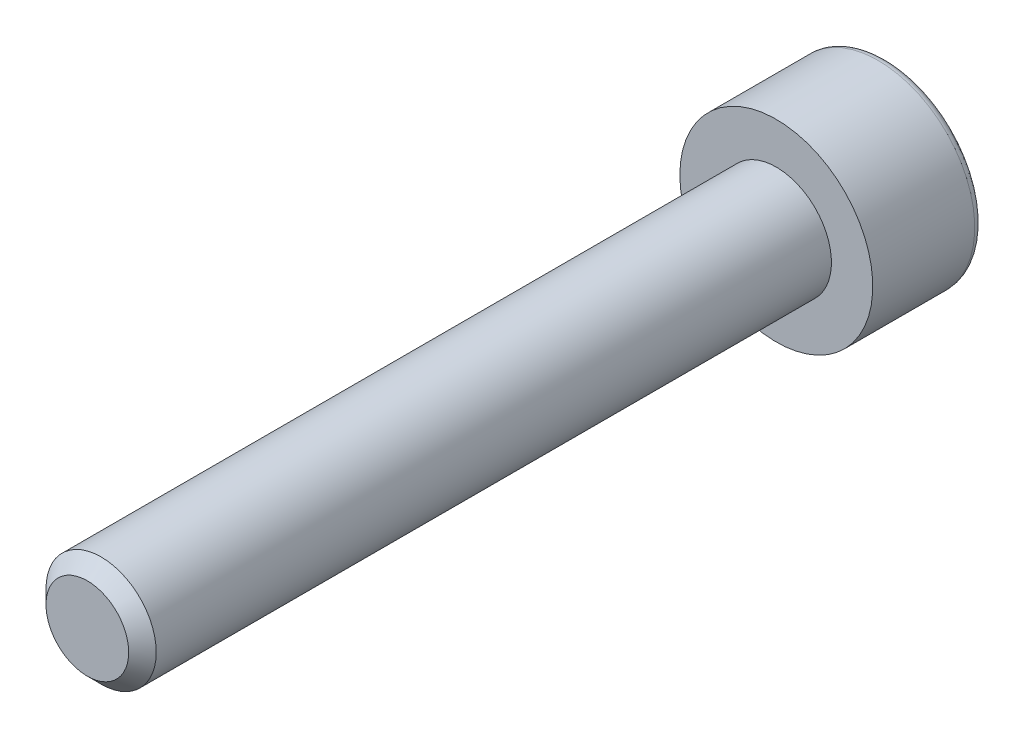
from build123d import *

# Parameters (mm, degrees)
ESQUISSE1_R             = 2
BASE_EXTRUSION_DEPTH    = 25
CHANFREIN1_SIZE         = 0.5
ESQUISSE2_R             = 3.5
BOSS_EXTRU_1_DEPTH      = 4
CONG_1_R                = 0.3
ENL_V_MAT_EXTRU_1_DEPTH = 4


with BuildPart() as part:
    # Esquisse1 → Base-Extrusion (new body)
    with BuildSketch(Plane.XY):
        Circle(ESQUISSE1_R)
    extrude(amount=BASE_EXTRUSION_DEPTH)

    # Chanfrein1
    chanfrein1_edges = [part.edges().sort_by_distance(p)[0] for p in [
        (-2, 0, 25),
    ]]
    chamfer(chanfrein1_edges, length=CHANFREIN1_SIZE)

    # Esquisse2 → Boss.-Extru.1 (add)
    with BuildSketch(Plane(origin=(0, 0, 0), x_dir=(-1, 0, 0), z_dir=(0, 0, -1))):
        Circle(ESQUISSE2_R)
    extrude(amount=BOSS_EXTRU_1_DEPTH)

    # Cong_1
    cong_1_edges = [part.edges().sort_by_distance(p)[0] for p in [
        (3.5, 0, -4),
    ]]
    fillet(cong_1_edges, radius=CONG_1_R)

    # Esquisse3 → Enl_v. mat.-Extru.1 (cut)
    with BuildSketch(Plane(origin=(0, 0, -4), x_dir=(-1, 0, 0), z_dir=(0, 0, -1))):
        Polygon((0, 1.732050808), (-1.5, 0.866025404), (-1.5, -0.866025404), (0, -1.732050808), (1.5, -0.866025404), (1.5, 0.866025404), align=None)
    extrude(amount=-ENL_V_MAT_EXTRU_1_DEPTH, mode=Mode.SUBTRACT)


solid = part.part
